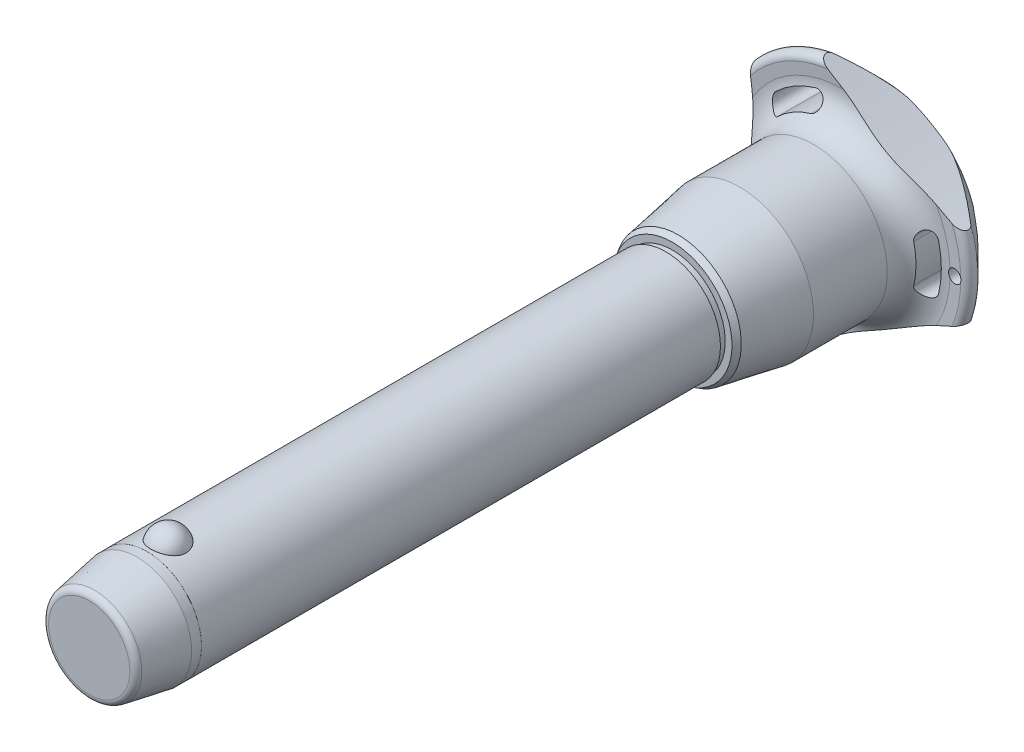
from build123d import *

# Parameters (mm, degrees)
SKETCH1_R           = 12.5
BOSS_EXTRUDE1_DEPTH = 110
SKETCH2_R           = 10
BOSS_EXTRUDE2_DEPTH = 50.7
BOSS_EXTRUDE3_START = 22
SKETCH1_2_R         = 12.5
BOSS_EXTRUDE3_DEPTH = 22
CHAMFER1_SIZE       = 11
CHAMFER1_SIZE2      = 1.939596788
FILLET1_R           = 1.5
SKETCH6_R           = 176.92625
CUT_EXTRUDE1_DEPTH  = 166.695054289
CIRPATTERN1_COUNT   = 3
SKETCH7_R           = 1.5
CUT_EXTRUDE2_DEPTH  = 166.603156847
SKETCH8_R           = 12.5
SKETCH8_R_2         = 12.49
CUT_EXTRUDE3_DEPTH  = 13.2


with BuildPart() as part:
    # Sketch1 → Boss-Extrude1 (new body)
    with BuildSketch(Plane.XY):
        Circle(SKETCH1_R)
    extrude(amount=-BOSS_EXTRUDE1_DEPTH)

    # Sketch2 → Boss-Extrude2 (add)
    with BuildSketch(Plane(origin=(0, 0, -110), x_dir=(-1, 0, 0), z_dir=(0, 0, -1))):
        with Locations(Location((0, 0, 0), (0, 0, 180))):
            Circle(SKETCH2_R)
    extrude(amount=BOSS_EXTRUDE2_DEPTH)

    # Sketch3 → Revolve1 (revolve)
    with BuildSketch(Plane(origin=(0, 0, 0), x_dir=(0, 0, -1), z_dir=(1, 0, 0))):
        with BuildLine():
            Line((-3.957271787, 15.4), (-3.957271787, 7.1))
            ThreePointArc((-3.957271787, 7.1), (0.192728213, 11.25), (-3.957271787, 15.4))
        make_face()
        with BuildLine():
            Line((-3.957271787, -7.1), (-3.957271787, -15.4))
            ThreePointArc((-3.957271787, -15.4), (0.192728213, -11.25), (-3.957271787, -7.1))
        make_face()
    revolve(axis=Axis((0, -7.1, 3.957271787), (0, 1, 0)))

    # Sketch1_2 → Boss-Extrude3 (add)
    with BuildSketch(Plane.XY.offset(BOSS_EXTRUDE3_START)):
        Circle(SKETCH1_2_R)
    extrude(amount=-BOSS_EXTRUDE3_DEPTH)

    # Chamfer1
    chamfer1_edges = [part.edges().sort_by_distance(p)[0] for p in [
        (-12.5, 0, 22),
    ]]
    chamfer1_side = [part.faces().sort_by_distance(p)[0] for p in [
        (-12.5, 0, -44),
    ]]
    chamfer(chamfer1_edges, length=CHAMFER1_SIZE, length2=CHAMFER1_SIZE2, reference=chamfer1_side[0])

    # Fillet1
    fillet1_edges = [part.edges().sort_by_distance(p)[0] for p in [
        (-10.560403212, 0, 22),
        (-10, 0, -160.7),
    ]]
    fillet(fillet1_edges, radius=FILLET1_R)

    # Sketch4 → Revolve2 (revolve)
    with BuildSketch(Plane(origin=(0, 0, 0), x_dir=(0, 0, -1), z_dir=(1, 0, 0)), mode=Mode.PRIVATE) as revolve2_sk:
        Polygon((110, 0), (110, 12.089202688), (111.5, 12.089202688), (111.5, 13.644437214), (112.846872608, 14.422054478), (126.9, 16.9), (143.8, 16.9), (143.8, 0), align=None)
    revolve(revolve2_sk.sketch.rotate(Axis((0, 0, -143.8), (0, 0, 1)), 90), axis=Axis((0, 0, -143.8), (0, 0, 1)))

    # Sketch5 → Revolve3 (revolve)
    with BuildSketch(Plane(origin=(0, 0, 0), x_dir=(0, 0, -1), z_dir=(1, 0, 0)), mode=Mode.PRIVATE) as revolve3_sk:
        with BuildLine():
            Line((150.790129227, 24.271609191), (150.652256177, 26.865060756))
            ThreePointArc((150.652256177, 26.865060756), (151.598671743, 28.411427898), (153.38137085, 28.08137085))
            Line((153.38137085, 28.08137085), (159.763226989, 21.69951471))
            ThreePointArc((159.763226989, 21.69951471), (160.7, 19.381044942), (159.683055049, 17.096604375))
            ThreePointArc((159.683055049, 17.096604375), (154.18864484, 9.321268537), (152.25, 0))
            Line((152.25, 0), (143.8, 0))
            Line((143.8, 0), (143.8, 16.9))
            ThreePointArc((143.8, 16.9), (148.879432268, 19.083427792), (150.790129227, 24.271609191))
        make_face()
    revolve(revolve3_sk.sketch.rotate(Axis((0, 0, -152.25), (0, 0, 1)), 90), axis=Axis((0, 0, -152.25), (0, 0, 1)))

    # Sketch6 → Cut-Extrude1 (cut, through all)
    with BuildSketch(Plane.XY):
        with Locations((-197.42625, 0)):
            Circle(SKETCH6_R)
        with BuildLine():
            ThreePointArc((21.802992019, -5.260839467), (22.428706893, 0), (21.802992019, 5.260839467))
            ThreePointArc((21.802992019, 5.260839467), (19.579234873, 6.620060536), (18.220013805, 4.39630339))
            ThreePointArc((18.220013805, 4.39630339), (18.742902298, 0), (18.220013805, -4.39630339))
            ThreePointArc((18.220013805, -4.39630339), (19.579234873, -6.620060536), (21.802992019, -5.260839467))
        make_face()
    cut_extrude1 = extrude(amount=-CUT_EXTRUDE1_DEPTH, mode=Mode.SUBTRACT)

    # CirPattern1: Cut-Extrude1 ×3 about axis
    cirpattern1_axis = Axis((0, 0, 0), (0, 0, 1))
    for i in range(1, CIRPATTERN1_COUNT):
        add(cut_extrude1.rotate(cirpattern1_axis, i * 360 / CIRPATTERN1_COUNT), mode=Mode.SUBTRACT)

    # Sketch7 → Cut-Extrude2 (cut, through all)
    with BuildSketch(Plane.XY):
        with Locations(Location((25.428706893, 0, 0), (0, 0, 17.230769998))):
            Circle(SKETCH7_R)
    extrude(amount=-CUT_EXTRUDE2_DEPTH, mode=Mode.SUBTRACT)

    # Sketch8 → Cut-Extrude3 (cut)
    with BuildSketch(Plane.XY.offset(22)):
        Circle(SKETCH8_R)
        Circle(SKETCH8_R_2, mode=Mode.SUBTRACT)
    extrude(amount=-CUT_EXTRUDE3_DEPTH, mode=Mode.SUBTRACT)


solid = part.part
